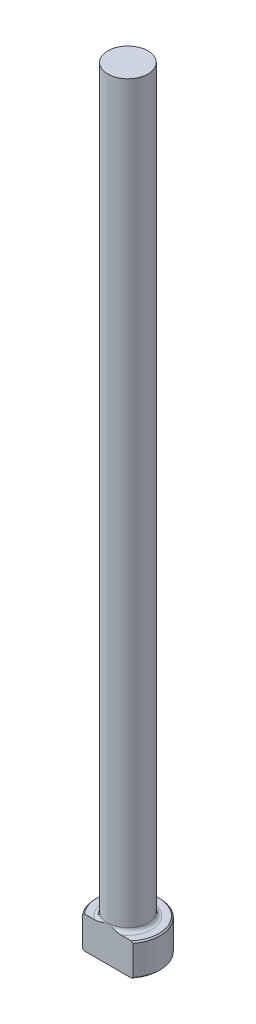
ISO-10303-21;
HEADER;
FILE_DESCRIPTION(('STEP AP214'),'2;1');
FILE_NAME('part.step','',(''),(''),'','','');
FILE_SCHEMA(('AUTOMOTIVE_DESIGN { 1 0 10303 214 1 1 1 1 }'));
ENDSEC;
DATA;
#1=APPLICATION_CONTEXT('core data for automotive mechanical design processes');
#2=APPLICATION_PROTOCOL_DEFINITION('international standard','automotive_design',2000,#1);
#3=PRODUCT_CONTEXT('',#1,'mechanical');
#4=PRODUCT('Part','Part','',(#3));
#5=PRODUCT_RELATED_PRODUCT_CATEGORY('part','',(#4));
#6=PRODUCT_DEFINITION_FORMATION('','',#4);
#7=PRODUCT_DEFINITION_CONTEXT('part definition',#1,'design');
#8=PRODUCT_DEFINITION('design','',#6,#7);
#9=PRODUCT_DEFINITION_SHAPE('','',#8);
#10=(LENGTH_UNIT() NAMED_UNIT(*) SI_UNIT(.MILLI.,.METRE.));
#11=(NAMED_UNIT(*) PLANE_ANGLE_UNIT() SI_UNIT($,.RADIAN.));
#12=(NAMED_UNIT(*) SI_UNIT($,.STERADIAN.) SOLID_ANGLE_UNIT());
#13=UNCERTAINTY_MEASURE_WITH_UNIT(LENGTH_MEASURE(1.E-05),#10,'distance_accuracy_value','');
#14=(GEOMETRIC_REPRESENTATION_CONTEXT(3) GLOBAL_UNCERTAINTY_ASSIGNED_CONTEXT((#13)) GLOBAL_UNIT_ASSIGNED_CONTEXT((#10,
#11,#12)) REPRESENTATION_CONTEXT('',''));
#15=CARTESIAN_POINT('',(0.,0.,0.));
#16=DIRECTION('',(0.,0.,1.));
#17=DIRECTION('',(1.,0.,0.));
#18=AXIS2_PLACEMENT_3D('',#15,#16,#17);
#19=CARTESIAN_POINT('',(0.,0.,0.));
#20=DIRECTION('',(0.,-1.,0.));
#21=DIRECTION('',(0.,0.,-1.));
#22=AXIS2_PLACEMENT_3D('',#19,#20,#21);
#23=PLANE('',#22);
#24=CARTESIAN_POINT('',(0.,0.,0.));
#25=DIRECTION('',(0.,-1.,0.));
#26=DIRECTION('',(0.,0.,-1.));
#27=AXIS2_PLACEMENT_3D('',#24,#25,#26);
#28=CIRCLE('',#27,6.09599999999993);
#29=CARTESIAN_POINT('',(-4.62711999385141,0.,3.96874999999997));
#30=VERTEX_POINT('',#29);
#31=CARTESIAN_POINT('',(4.62711999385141,0.,3.96874999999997));
#32=VERTEX_POINT('',#31);
#33=EDGE_CURVE('E98',#30,#32,#28,.T.);
#34=ORIENTED_EDGE('',*,*,#33,.T.);
#35=DIRECTION('',(-1.,0.,0.));
#36=VECTOR('',#35,1.);
#37=CARTESIAN_POINT('',(-4.95696716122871,0.,3.96874999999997));
#38=LINE('',#37,#36);
#39=EDGE_CURVE('E83',#32,#30,#38,.T.);
#40=ORIENTED_EDGE('',*,*,#39,.T.);
#41=EDGE_LOOP('',(#34,#40));
#42=FACE_BOUND('',#41,.T.);
#43=ADVANCED_FACE('F32',(#42),#23,.T.);
#44=CARTESIAN_POINT('',(0.,259.958771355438,0.));
#45=DIRECTION('',(0.,1.,0.));
#46=DIRECTION('',(0.,0.,1.));
#47=AXIS2_PLACEMENT_3D('',#44,#45,#46);
#48=CYLINDRICAL_SURFACE('',#47,6.34999999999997);
#49=CARTESIAN_POINT('',(0.,6.09599999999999,0.));
#50=DIRECTION('',(0.,1.,0.));
#51=DIRECTION('',(0.,0.,1.));
#52=AXIS2_PLACEMENT_3D('',#49,#50,#51);
#53=CIRCLE('',#52,6.34999999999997);
#54=CARTESIAN_POINT('',(-4.95696716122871,6.09599999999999,3.96874999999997));
#55=VERTEX_POINT('',#54);
#56=CARTESIAN_POINT('',(4.95696716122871,6.09599999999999,3.96874999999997));
#57=VERTEX_POINT('',#56);
#58=EDGE_CURVE('E104',#55,#57,#53,.F.);
#59=ORIENTED_EDGE('',*,*,#58,.T.);
#60=DIRECTION('',(0.,-1.,0.));
#61=VECTOR('',#60,1.);
#62=CARTESIAN_POINT('',(4.95696716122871,152.4,3.96874999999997));
#63=LINE('',#62,#61);
#64=CARTESIAN_POINT('',(4.95696716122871,0.254000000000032,3.96874999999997));
#65=VERTEX_POINT('',#64);
#66=EDGE_CURVE('E183',#57,#65,#63,.T.);
#67=ORIENTED_EDGE('',*,*,#66,.T.);
#68=CARTESIAN_POINT('',(0.,0.254000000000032,0.));
#69=DIRECTION('',(0.,-1.,0.));
#70=DIRECTION('',(0.,0.,-1.));
#71=AXIS2_PLACEMENT_3D('',#68,#69,#70);
#72=CIRCLE('',#71,6.34999999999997);
#73=CARTESIAN_POINT('',(-4.95696716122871,0.254000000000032,3.96874999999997));
#74=VERTEX_POINT('',#73);
#75=EDGE_CURVE('E100',#65,#74,#72,.F.);
#76=ORIENTED_EDGE('',*,*,#75,.T.);
#77=DIRECTION('',(0.,-1.,0.));
#78=VECTOR('',#77,1.);
#79=CARTESIAN_POINT('',(-4.95696716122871,152.4,3.96874999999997));
#80=LINE('',#79,#78);
#81=EDGE_CURVE('E93',#55,#74,#80,.T.);
#82=ORIENTED_EDGE('',*,*,#81,.F.);
#83=EDGE_LOOP('',(#59,#67,#76,#82));
#84=FACE_BOUND('',#83,.T.);
#85=ADVANCED_FACE('F158',(#84),#48,.T.);
#86=CARTESIAN_POINT('',(-6.34999999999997,6.35,0.));
#87=DIRECTION('',(0.,1.,0.));
#88=DIRECTION('',(0.,0.,1.));
#89=AXIS2_PLACEMENT_3D('',#86,#87,#88);
#90=PLANE('',#89);
#91=CARTESIAN_POINT('',(0.,6.35,0.));
#92=DIRECTION('',(0.,1.,0.));
#93=DIRECTION('',(0.,0.,1.));
#94=AXIS2_PLACEMENT_3D('',#91,#92,#93);
#95=CIRCLE('',#94,6.096);
#96=CARTESIAN_POINT('',(4.62711999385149,6.35,3.96874999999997));
#97=VERTEX_POINT('',#96);
#98=CARTESIAN_POINT('',(-4.62711999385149,6.35,3.96874999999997));
#99=VERTEX_POINT('',#98);
#100=EDGE_CURVE('E178',#97,#99,#95,.T.);
#101=ORIENTED_EDGE('',*,*,#100,.T.);
#102=DIRECTION('',(1.,0.,0.));
#103=VECTOR('',#102,1.);
#104=CARTESIAN_POINT('',(-6.34999999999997,6.35,3.96874999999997));
#105=LINE('',#104,#103);
#106=CARTESIAN_POINT('',(-2.57468813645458,6.35000000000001,3.96874999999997));
#107=VERTEX_POINT('',#106);
#108=EDGE_CURVE('E57',#99,#107,#105,.T.);
#109=ORIENTED_EDGE('',*,*,#108,.T.);
#110=CARTESIAN_POINT('',(0.,6.35,0.));
#111=DIRECTION('',(0.,1.,0.));
#112=DIRECTION('',(0.,0.,1.));
#113=AXIS2_PLACEMENT_3D('',#110,#111,#112);
#114=CIRCLE('',#113,4.73074999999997);
#115=CARTESIAN_POINT('',(2.57468813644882,6.35000000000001,3.96874999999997));
#116=VERTEX_POINT('',#115);
#117=EDGE_CURVE('E107',#107,#116,#114,.F.);
#118=ORIENTED_EDGE('',*,*,#117,.T.);
#119=EDGE_CURVE('E136',#116,#97,#105,.T.);
#120=ORIENTED_EDGE('',*,*,#119,.T.);
#121=EDGE_LOOP('',(#101,#109,#118,#120));
#122=FACE_BOUND('',#121,.T.);
#123=ADVANCED_FACE('F147',(#122),#90,.T.);
#124=CARTESIAN_POINT('',(0.,6.35000000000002,0.));
#125=DIRECTION('',(0.,-1.,0.));
#126=DIRECTION('',(0.,0.,-1.));
#127=AXIS2_PLACEMENT_3D('',#124,#125,#126);
#128=CONICAL_SURFACE('',#127,6.09599999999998,0.78539816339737);
#129=ORIENTED_EDGE('',*,*,#58,.F.);
#130=CARTESIAN_POINT('',(-10.9074797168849,0.838929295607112,3.96874999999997));
#131=CARTESIAN_POINT('',(-10.7362098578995,0.999873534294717,3.96874999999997));
#132=CARTESIAN_POINT('',(-10.5647219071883,1.16058556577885,3.96874999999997));
#133=CARTESIAN_POINT('',(-10.2212389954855,1.48146888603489,3.96874999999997));
#134=CARTESIAN_POINT('',(-10.0492440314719,1.64164017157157,3.96874999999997));
#135=CARTESIAN_POINT('',(-9.5321572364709,2.12144657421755,3.96874999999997));
#136=CARTESIAN_POINT('',(-9.18620012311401,2.44015148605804,3.96874999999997));
#137=CARTESIAN_POINT('',(-8.48250908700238,3.0820994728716,3.96874999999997));
#138=CARTESIAN_POINT('',(-8.12469692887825,3.40525689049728,3.96874999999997));
#139=CARTESIAN_POINT('',(-7.40476794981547,4.04632494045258,3.96874999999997));
#140=CARTESIAN_POINT('',(-7.04265387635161,4.36423864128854,3.96874999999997));
#141=CARTESIAN_POINT('',(-6.49464785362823,4.83529502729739,3.96874999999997));
#142=CARTESIAN_POINT('',(-6.31122194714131,4.99130476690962,3.96874999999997));
#143=CARTESIAN_POINT('',(-5.94233504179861,5.30091560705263,3.96874999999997));
#144=CARTESIAN_POINT('',(-5.75687398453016,5.45451663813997,3.96874999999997));
#145=CARTESIAN_POINT('',(-5.38307682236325,5.7589450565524,3.96874999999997));
#146=CARTESIAN_POINT('',(-5.1947357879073,5.90976640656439,3.96874999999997));
#147=CARTESIAN_POINT('',(-4.81490900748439,6.20737957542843,3.96874999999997));
#148=CARTESIAN_POINT('',(-4.62342351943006,6.35417172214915,3.96874999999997));
#149=CARTESIAN_POINT('',(-4.23840402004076,6.64094245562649,3.96874999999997));
#150=CARTESIAN_POINT('',(-4.04491037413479,6.7809749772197,3.96874999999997));
#151=CARTESIAN_POINT('',(-3.6528243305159,7.05394467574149,3.96874999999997));
#152=CARTESIAN_POINT('',(-3.45422994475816,7.18687902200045,3.96874999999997));
#153=CARTESIAN_POINT('',(-3.05130630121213,7.44227984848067,3.96874999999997));
#154=CARTESIAN_POINT('',(-2.84699866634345,7.56478015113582,3.96874999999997));
#155=CARTESIAN_POINT('',(-2.43048905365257,7.79538986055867,3.96874999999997));
#156=CARTESIAN_POINT('',(-2.21829552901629,7.90351413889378,3.96874999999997));
#157=CARTESIAN_POINT('',(-1.88022874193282,8.05571524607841,3.96874999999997));
#158=CARTESIAN_POINT('',(-1.75760714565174,8.10699294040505,3.96874999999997));
#159=CARTESIAN_POINT('',(-1.50924598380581,8.20152084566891,3.96874999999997));
#160=CARTESIAN_POINT('',(-1.38350591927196,8.24476976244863,3.96874999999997));
#161=CARTESIAN_POINT('',(-1.12977963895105,8.32133629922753,3.96874999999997));
#162=CARTESIAN_POINT('',(-1.00181028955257,8.35470906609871,3.96874999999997));
#163=CARTESIAN_POINT('',(-0.74342759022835,8.41019049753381,3.96874999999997));
#164=CARTESIAN_POINT('',(-0.613014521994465,8.43230045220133,3.96874999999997));
#165=CARTESIAN_POINT('',(-0.348820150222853,8.46413643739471,3.96874999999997));
#166=CARTESIAN_POINT('',(-0.215017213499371,8.47368667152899,3.96874999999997));
#167=CARTESIAN_POINT('',(0.0528592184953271,8.47915710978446,3.96874999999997));
#168=CARTESIAN_POINT('',(0.186932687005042,8.47507860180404,3.96874999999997));
#169=CARTESIAN_POINT('',(0.454438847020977,8.45355129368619,3.96874999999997));
#170=CARTESIAN_POINT('',(0.587867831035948,8.4360572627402,3.96874999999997));
#171=CARTESIAN_POINT('',(0.852531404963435,8.38880841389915,3.96874999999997));
#172=CARTESIAN_POINT('',(0.983765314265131,8.35904986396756,3.96874999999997));
#173=CARTESIAN_POINT('',(1.28880023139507,8.27664707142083,3.96874999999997));
#174=CARTESIAN_POINT('',(1.46141329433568,8.21963783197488,3.96874999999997));
#175=CARTESIAN_POINT('',(1.80090006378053,8.09060275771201,3.96874999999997));
#176=CARTESIAN_POINT('',(1.96777052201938,8.01856858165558,3.96874999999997));
#177=CARTESIAN_POINT('',(2.21492486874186,7.90160331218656,3.96874999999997));
#178=CARTESIAN_POINT('',(2.29724213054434,7.86087235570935,3.96874999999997));
#179=CARTESIAN_POINT('',(2.46058693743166,7.77689381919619,3.96874999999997));
#180=CARTESIAN_POINT('',(2.54161446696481,7.7336462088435,3.96874999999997));
#181=CARTESIAN_POINT('',(2.70243717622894,7.64499560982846,3.96874999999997));
#182=CARTESIAN_POINT('',(2.78223280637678,7.59959343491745,3.96874999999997));
#183=CARTESIAN_POINT('',(2.94071403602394,7.50690571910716,3.96874999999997));
#184=CARTESIAN_POINT('',(3.01939969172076,7.45962027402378,3.96874999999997));
#185=CARTESIAN_POINT('',(3.28991241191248,7.2931914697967,3.96874999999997));
#186=CARTESIAN_POINT('',(3.47920753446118,7.16992469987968,3.96874999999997));
#187=CARTESIAN_POINT('',(3.85299575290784,6.9162846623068,3.96874999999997));
#188=CARTESIAN_POINT('',(4.03748740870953,6.78590929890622,3.96874999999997));
#189=CARTESIAN_POINT('',(4.4028151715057,6.5197792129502,3.96874999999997));
#190=CARTESIAN_POINT('',(4.58364746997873,6.38401928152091,3.96874999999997));
#191=CARTESIAN_POINT('',(4.94222498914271,6.10853910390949,3.96874999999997));
#192=CARTESIAN_POINT('',(5.1199705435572,5.96881929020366,3.96874999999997));
#193=CARTESIAN_POINT('',(5.4737355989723,5.68571433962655,3.96874999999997));
#194=CARTESIAN_POINT('',(5.64974474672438,5.54231629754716,3.96874999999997));
#195=CARTESIAN_POINT('',(5.99974206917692,5.25307243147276,3.96874999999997));
#196=CARTESIAN_POINT('',(6.17373019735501,5.10722655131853,3.96874999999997));
#197=CARTESIAN_POINT('',(6.69302814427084,4.66694445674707,3.96874999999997));
#198=CARTESIAN_POINT('',(7.0358720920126,4.36960132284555,3.96874999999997));
#199=CARTESIAN_POINT('',(7.67698172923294,3.80499574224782,3.96874999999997));
#200=CARTESIAN_POINT('',(7.97575257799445,3.53830334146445,3.96874999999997));
#201=CARTESIAN_POINT('',(8.57066794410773,3.0019136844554,3.96874999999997));
#202=CARTESIAN_POINT('',(8.86681204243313,2.73221596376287,3.96874999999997));
#203=CARTESIAN_POINT('',(9.45462121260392,2.19284079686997,3.96874999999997));
#204=CARTESIAN_POINT('',(9.74630307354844,1.92318161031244,3.96874999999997));
#205=CARTESIAN_POINT('',(10.3280138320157,1.38219972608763,3.96874999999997));
#206=CARTESIAN_POINT('',(10.6180430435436,1.11087736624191,3.96874999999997));
#207=CARTESIAN_POINT('',(10.9074797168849,0.838929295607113,3.96874999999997));
#208=B_SPLINE_CURVE_WITH_KNOTS('',3,(#130,#131,#132,#133,#134,#135,#136,#137,#138,#139,#140,
#141,#142,#143,#144,#145,#146,#147,#148,#149,#150,#151,#152,#153,#154,#155,#156,#157,#158,#159,
#160,#161,#162,#163,#164,#165,#166,#167,#168,#169,#170,#171,#172,#173,#174,#175,#176,#177,#178,
#179,#180,#181,#182,#183,#184,#185,#186,#187,#188,#189,#190,#191,#192,#193,#194,#195,#196,#197,
#198,#199,#200,#201,#202,#203,#204,#205,#206,#207),.UNSPECIFIED.,.F.,.F.,(4,2,2,2,2,2,2,2,2,2,2,
2,2,2,2,2,2,2,2,2,2,2,2,2,2,2,2,2,2,2,2,2,2,2,2,2,2,2,4),(0.,0.705072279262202,1.41014876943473,
2.82127665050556,4.2676729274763,5.7131904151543,6.43557153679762,7.15797344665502,
7.88179359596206,8.60555467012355,9.32198841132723,10.0387057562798,10.7530036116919,
11.4665567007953,11.8650702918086,12.2636480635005,12.6599563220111,13.0562191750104,
13.457971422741,13.8596857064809,14.2627603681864,14.6659577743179,15.2103582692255,
15.7550618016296,16.0305566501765,16.306054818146,16.581449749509,16.8568306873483,
17.5342490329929,18.2118681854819,18.8901596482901,19.5683773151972,20.2494368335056,
20.9305119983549,22.2918881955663,23.4933255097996,24.6949511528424,25.8866442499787,
27.078102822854),.UNSPECIFIED.);
#209=EDGE_CURVE('E135',#55,#99,#208,.T.);
#210=ORIENTED_EDGE('',*,*,#209,.T.);
#211=ORIENTED_EDGE('',*,*,#100,.F.);
#212=EDGE_CURVE('E127',#97,#57,#208,.T.);
#213=ORIENTED_EDGE('',*,*,#212,.T.);
#214=EDGE_LOOP('',(#129,#210,#211,#213));
#215=FACE_BOUND('',#214,.T.);
#216=ADVANCED_FACE('F143',(#215),#128,.T.);
#217=CARTESIAN_POINT('',(0.,0.254000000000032,0.));
#218=DIRECTION('',(0.,1.,0.));
#219=DIRECTION('',(0.,0.,1.));
#220=AXIS2_PLACEMENT_3D('',#217,#218,#219);
#221=CONICAL_SURFACE('',#220,6.34999999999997,0.785398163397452);
#222=ORIENTED_EDGE('',*,*,#75,.F.);
#223=CARTESIAN_POINT('',(10.9074797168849,5.51107070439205,3.96874999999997));
#224=CARTESIAN_POINT('',(10.7362098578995,5.35012646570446,3.96874999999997));
#225=CARTESIAN_POINT('',(10.5647219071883,5.18941443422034,3.96874999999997));
#226=CARTESIAN_POINT('',(10.2212389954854,4.86853111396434,3.96874999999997));
#227=CARTESIAN_POINT('',(10.0492440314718,4.70835982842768,3.96874999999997));
#228=CARTESIAN_POINT('',(9.53215723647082,4.22855342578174,3.96874999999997));
#229=CARTESIAN_POINT('',(9.18620012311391,3.90984851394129,3.96874999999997));
#230=CARTESIAN_POINT('',(8.48250908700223,3.26790052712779,3.96874999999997));
#231=CARTESIAN_POINT('',(8.12469692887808,2.94474310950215,3.96874999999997));
#232=CARTESIAN_POINT('',(7.40476794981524,2.3036750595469,3.96874999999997));
#233=CARTESIAN_POINT('',(7.04265387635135,1.98576135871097,3.96874999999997));
#234=CARTESIAN_POINT('',(6.49464785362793,1.51470497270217,3.96874999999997));
#235=CARTESIAN_POINT('',(6.311221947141,1.35869523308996,3.96874999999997));
#236=CARTESIAN_POINT('',(5.94233504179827,1.04908439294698,3.96874999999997));
#237=CARTESIAN_POINT('',(5.75687398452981,0.895483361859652,3.96874999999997));
#238=CARTESIAN_POINT('',(5.38307682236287,0.591054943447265,3.96874999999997));
#239=CARTESIAN_POINT('',(5.19473578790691,0.440233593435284,3.96874999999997));
#240=CARTESIAN_POINT('',(4.81490900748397,0.142620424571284,3.96874999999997));
#241=CARTESIAN_POINT('',(4.62342351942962,-0.00417172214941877,3.96874999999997));
#242=CARTESIAN_POINT('',(4.23840402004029,-0.290942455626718,3.96874999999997));
#243=CARTESIAN_POINT('',(4.04491037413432,-0.430974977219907,3.96874999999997));
#244=CARTESIAN_POINT('',(3.6528243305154,-0.703944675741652,3.96874999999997));
#245=CARTESIAN_POINT('',(3.45422994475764,-0.836879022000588,3.96874999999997));
#246=CARTESIAN_POINT('',(3.05130630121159,-1.09227984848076,3.96874999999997));
#247=CARTESIAN_POINT('',(2.84699866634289,-1.21478015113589,3.96874999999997));
#248=CARTESIAN_POINT('',(2.43048905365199,-1.44538986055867,3.96874999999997));
#249=CARTESIAN_POINT('',(2.2182955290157,-1.55351413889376,3.96874999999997));
#250=CARTESIAN_POINT('',(1.8802287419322,-1.70571524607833,3.96874999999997));
#251=CARTESIAN_POINT('',(1.75760714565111,-1.75699294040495,3.96874999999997));
#252=CARTESIAN_POINT('',(1.50924598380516,-1.85152084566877,3.96874999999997));
#253=CARTESIAN_POINT('',(1.3835059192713,-1.89476976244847,3.96874999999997));
#254=CARTESIAN_POINT('',(1.12977963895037,-1.97133629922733,3.96874999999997));
#255=CARTESIAN_POINT('',(1.00181028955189,-2.00470906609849,3.96874999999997));
#256=CARTESIAN_POINT('',(0.743427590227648,-2.06019049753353,3.96874999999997));
#257=CARTESIAN_POINT('',(0.613014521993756,-2.08230045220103,3.96874999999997));
#258=CARTESIAN_POINT('',(0.348820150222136,-2.11413643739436,3.96874999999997));
#259=CARTESIAN_POINT('',(0.215017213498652,-2.12368667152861,3.96874999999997));
#260=CARTESIAN_POINT('',(-0.0528592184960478,-2.12915710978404,3.96874999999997));
#261=CARTESIAN_POINT('',(-0.186932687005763,-2.1250786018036,3.96874999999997));
#262=CARTESIAN_POINT('',(-0.454438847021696,-2.1035512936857,3.96874999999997));
#263=CARTESIAN_POINT('',(-0.587867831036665,-2.08605726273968,3.96874999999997));
#264=CARTESIAN_POINT('',(-0.852531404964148,-2.0388084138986,3.96874999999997));
#265=CARTESIAN_POINT('',(-0.983765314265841,-2.00904986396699,3.96874999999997));
#266=CARTESIAN_POINT('',(-1.28880023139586,-1.92664707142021,3.96874999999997));
#267=CARTESIAN_POINT('',(-1.46141329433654,-1.86963783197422,3.96874999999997));
#268=CARTESIAN_POINT('',(-1.80090006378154,-1.74060275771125,3.96874999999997));
#269=CARTESIAN_POINT('',(-1.96777052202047,-1.66856858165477,3.96874999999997));
#270=CARTESIAN_POINT('',(-2.21492486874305,-1.55160331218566,3.96874999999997));
#271=CARTESIAN_POINT('',(-2.29724213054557,-1.51087235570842,3.96874999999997));
#272=CARTESIAN_POINT('',(-2.46058693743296,-1.42689381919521,3.96874999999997));
#273=CARTESIAN_POINT('',(-2.54161446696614,-1.38364620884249,3.96874999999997));
#274=CARTESIAN_POINT('',(-2.70243717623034,-1.2949956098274,3.96874999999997));
#275=CARTESIAN_POINT('',(-2.78223280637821,-1.24959343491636,3.96874999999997));
#276=CARTESIAN_POINT('',(-2.94071403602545,-1.15690571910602,3.96874999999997));
#277=CARTESIAN_POINT('',(-3.0193996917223,-1.1096202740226,3.96874999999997));
#278=CARTESIAN_POINT('',(-3.28991241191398,-0.943191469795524,3.96874999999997));
#279=CARTESIAN_POINT('',(-3.47920753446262,-0.819924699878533,3.96874999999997));
#280=CARTESIAN_POINT('',(-3.85299575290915,-0.566284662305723,3.96874999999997));
#281=CARTESIAN_POINT('',(-4.03748740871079,-0.435909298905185,3.96874999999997));
#282=CARTESIAN_POINT('',(-4.40281517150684,-0.169779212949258,3.96874999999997));
#283=CARTESIAN_POINT('',(-4.58364746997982,-0.0340192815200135,3.96874999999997));
#284=CARTESIAN_POINT('',(-4.9422249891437,0.241460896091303,3.96874999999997));
#285=CARTESIAN_POINT('',(-5.11997054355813,0.38118070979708,3.96874999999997));
#286=CARTESIAN_POINT('',(-5.47373559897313,0.664285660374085,3.96874999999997));
#287=CARTESIAN_POINT('',(-5.64974474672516,0.807683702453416,3.96874999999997));
#288=CARTESIAN_POINT('',(-5.99974206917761,1.0969275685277,3.96874999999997));
#289=CARTESIAN_POINT('',(-6.17373019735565,1.24277344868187,3.96874999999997));
#290=CARTESIAN_POINT('',(-6.69302814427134,1.68305554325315,3.96874999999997));
#291=CARTESIAN_POINT('',(-7.03587209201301,1.98039867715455,3.96874999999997));
#292=CARTESIAN_POINT('',(-7.67698172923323,2.54500425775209,3.96874999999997));
#293=CARTESIAN_POINT('',(-7.97575257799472,2.81169665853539,3.96874999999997));
#294=CARTESIAN_POINT('',(-8.57066794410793,3.3480863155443,3.96874999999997));
#295=CARTESIAN_POINT('',(-8.8668120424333,3.61778403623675,3.96874999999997));
#296=CARTESIAN_POINT('',(-9.45462121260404,4.15715920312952,3.96874999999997));
#297=CARTESIAN_POINT('',(-9.74630307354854,4.42681838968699,3.96874999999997));
#298=CARTESIAN_POINT('',(-10.3280138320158,4.96780027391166,3.96874999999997));
#299=CARTESIAN_POINT('',(-10.6180430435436,5.23912263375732,3.96874999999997));
#300=CARTESIAN_POINT('',(-10.9074797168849,5.51107070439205,3.96874999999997));
#301=B_SPLINE_CURVE_WITH_KNOTS('',3,(#223,#224,#225,#226,#227,#228,#229,#230,#231,#232,#233,
#234,#235,#236,#237,#238,#239,#240,#241,#242,#243,#244,#245,#246,#247,#248,#249,#250,#251,#252,
#253,#254,#255,#256,#257,#258,#259,#260,#261,#262,#263,#264,#265,#266,#267,#268,#269,#270,#271,
#272,#273,#274,#275,#276,#277,#278,#279,#280,#281,#282,#283,#284,#285,#286,#287,#288,#289,#290,
#291,#292,#293,#294,#295,#296,#297,#298,#299,#300),.UNSPECIFIED.,.F.,.F.,(4,2,2,2,2,2,2,2,2,2,2,
2,2,2,2,2,2,2,2,2,2,2,2,2,2,2,2,2,2,2,2,2,2,2,2,2,2,2,4),(0.,0.705072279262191,1.4101487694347,
2.82127665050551,4.26767292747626,5.71319041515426,6.43557153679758,7.15797344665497,
7.88179359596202,8.6055546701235,9.32198841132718,10.0387057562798,10.7530036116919,
11.4665567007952,11.8650702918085,12.2636480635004,12.659956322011,13.0562191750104,
13.4579714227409,13.8596857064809,14.2627603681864,14.6659577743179,15.2103582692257,
15.7550618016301,16.0305566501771,16.3060548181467,16.5814497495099,16.8568306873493,
17.5342490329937,18.2118681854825,18.8901596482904,19.5683773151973,20.2494368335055,
20.9305119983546,22.2918881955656,23.4933255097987,24.6949511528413,25.8866442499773,
27.0781028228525),.UNSPECIFIED.);
#302=EDGE_CURVE('E86',#65,#32,#301,.T.);
#303=ORIENTED_EDGE('',*,*,#302,.T.);
#304=ORIENTED_EDGE('',*,*,#33,.F.);
#305=EDGE_CURVE('E89',#30,#74,#301,.T.);
#306=ORIENTED_EDGE('',*,*,#305,.T.);
#307=EDGE_LOOP('',(#222,#303,#304,#306));
#308=FACE_BOUND('',#307,.T.);
#309=ADVANCED_FACE('F97',(#308),#221,.T.);
#310=CARTESIAN_POINT('',(0.,7.11200000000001,0.));
#311=DIRECTION('',(0.,1.,0.));
#312=DIRECTION('',(0.,0.,1.));
#313=AXIS2_PLACEMENT_3D('',#310,#311,#312);
#314=TOROIDAL_SURFACE('',#313,4.73074999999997,0.762);
#315=CARTESIAN_POINT('',(0.,7.11200000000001,3.96874999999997));
#316=CARTESIAN_POINT('',(2.72452919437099E-10,7.11200100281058,3.96874999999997));
#317=CARTESIAN_POINT('',(1.8909757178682E-07,7.11200200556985,3.96874999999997));
#318=CARTESIAN_POINT('',(7.99901126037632E-07,7.11200394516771,3.96874999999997));
#319=CARTESIAN_POINT('',(1.22666624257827E-06,7.11200488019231,3.96874999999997));
#320=CARTESIAN_POINT('',(2.25601477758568E-06,7.11200673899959,3.96874999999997));
#321=CARTESIAN_POINT('',(2.86938872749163E-06,7.11200765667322,3.96874999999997));
#322=CARTESIAN_POINT('',(4.20094100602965E-06,7.11200939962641,3.96874999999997));
#323=CARTESIAN_POINT('',(4.91843246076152E-06,7.11201022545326,3.96874999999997));
#324=CARTESIAN_POINT('',(7.46258045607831E-06,7.11201295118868,3.96874999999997));
#325=CARTESIAN_POINT('',(9.42693843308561E-06,7.1120147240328,3.96874999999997));
#326=CARTESIAN_POINT('',(1.35156238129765E-05,7.11201792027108,3.96874999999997));
#327=CARTESIAN_POINT('',(1.56334419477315E-05,7.11201935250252,3.96874999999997));
#328=CARTESIAN_POINT('',(2.3779436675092E-05,7.11202462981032,3.96874999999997));
#329=CARTESIAN_POINT('',(3.00000425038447E-05,7.11202818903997,3.96874999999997));
#330=CARTESIAN_POINT('',(4.23604378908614E-05,7.11203410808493,3.96874999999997));
#331=CARTESIAN_POINT('',(4.84662900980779E-05,7.11203654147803,3.96874999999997));
#332=CARTESIAN_POINT('',(7.41361994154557E-05,7.11204669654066,3.96874999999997));
#333=CARTESIAN_POINT('',(9.37464431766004E-05,7.11205427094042,3.96874999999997));
#334=CARTESIAN_POINT('',(0.000130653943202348,7.1120666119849,3.96874999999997));
#335=CARTESIAN_POINT('',(0.000147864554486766,7.11207162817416,3.96874999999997));
#336=CARTESIAN_POINT('',(0.000271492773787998,7.11211085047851,3.96874999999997));
#337=CARTESIAN_POINT('',(0.000372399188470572,7.11216017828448,3.96874999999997));
#338=CARTESIAN_POINT('',(0.000762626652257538,7.11234384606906,3.96874999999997));
#339=CARTESIAN_POINT('',(0.00105578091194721,7.11246696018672,3.96874999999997));
#340=CARTESIAN_POINT('',(0.00218658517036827,7.11294905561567,3.96874999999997));
#341=CARTESIAN_POINT('',(0.00302029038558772,7.11331980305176,3.96874999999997));
#342=CARTESIAN_POINT('',(0.00641326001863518,7.1148212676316,3.96874999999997));
#343=CARTESIAN_POINT('',(0.00897690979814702,7.1159386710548,3.96874999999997));
#344=CARTESIAN_POINT('',(0.0431521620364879,7.13084393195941,3.96874999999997));
#345=CARTESIAN_POINT('',(0.0747329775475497,7.14472589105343,3.96874999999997));
#346=CARTESIAN_POINT('',(0.138371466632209,7.17259981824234,3.96874999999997));
#347=CARTESIAN_POINT('',(0.170429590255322,7.18659058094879,3.96874999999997));
#348=CARTESIAN_POINT('',(0.263897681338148,7.22728018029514,3.96874999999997));
#349=CARTESIAN_POINT('',(0.325342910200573,7.25390148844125,3.96874999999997));
#350=CARTESIAN_POINT('',(0.455451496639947,7.30966012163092,3.96874999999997));
#351=CARTESIAN_POINT('',(0.524140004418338,7.33873873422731,3.96874999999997));
#352=CARTESIAN_POINT('',(0.662588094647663,7.39626071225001,3.96874999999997));
#353=CARTESIAN_POINT('',(0.732351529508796,7.42469485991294,3.96874999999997));
#354=CARTESIAN_POINT('',(0.854677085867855,7.47322946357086,3.96874999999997));
#355=CARTESIAN_POINT('',(0.90712454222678,7.49361793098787,3.96874999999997));
#356=CARTESIAN_POINT('',(1.01222990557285,7.5334595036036,3.96874999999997));
#357=CARTESIAN_POINT('',(1.06488701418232,7.55291472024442,3.96874999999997));
#358=CARTESIAN_POINT('',(1.22118224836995,7.60890100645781,3.96874999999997));
#359=CARTESIAN_POINT('',(1.32536392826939,7.64394780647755,3.96874999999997));
#360=CARTESIAN_POINT('',(1.51475689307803,7.70222633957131,3.96874999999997));
#361=CARTESIAN_POINT('',(1.59966831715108,7.72642606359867,3.96874999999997));
#362=CARTESIAN_POINT('',(1.77115576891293,7.77055798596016,3.96874999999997));
#363=CARTESIAN_POINT('',(1.85773874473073,7.79046358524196,3.96874999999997));
#364=CARTESIAN_POINT('',(2.03663433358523,7.8256694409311,3.96874999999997));
#365=CARTESIAN_POINT('',(2.12900742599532,7.84066973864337,3.96874999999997));
#366=CARTESIAN_POINT('',(2.31450882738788,7.86300878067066,3.96874999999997));
#367=CARTESIAN_POINT('',(2.40763490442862,7.87036510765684,3.96874999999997));
#368=CARTESIAN_POINT('',(2.58622461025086,7.87533872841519,3.96874999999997));
#369=CARTESIAN_POINT('',(2.67166229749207,7.87373524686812,3.96874999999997));
#370=CARTESIAN_POINT('',(2.84116133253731,7.86073590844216,3.96874999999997));
#371=CARTESIAN_POINT('',(2.92522821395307,7.84942227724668,3.96874999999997));
#372=CARTESIAN_POINT('',(3.09260159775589,7.81445437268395,3.96874999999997));
#373=CARTESIAN_POINT('',(3.17586039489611,7.79056108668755,3.96874999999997));
#374=CARTESIAN_POINT('',(3.33637449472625,7.72711703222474,3.96874999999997));
#375=CARTESIAN_POINT('',(3.41365062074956,7.6876237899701,3.96874999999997));
#376=CARTESIAN_POINT('',(3.51798857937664,7.61566535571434,3.96874999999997));
#377=CARTESIAN_POINT('',(3.55006318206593,7.59045187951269,3.96874999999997));
#378=CARTESIAN_POINT('',(3.6102188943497,7.53557765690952,3.96874999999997));
#379=CARTESIAN_POINT('',(3.63830099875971,7.50591802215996,3.96874999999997));
#380=CARTESIAN_POINT('',(3.68933162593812,7.44181271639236,3.96874999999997));
#381=CARTESIAN_POINT('',(3.7122145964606,7.40731395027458,3.96874999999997));
#382=CARTESIAN_POINT('',(3.75063172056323,7.3344255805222,3.96874999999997));
#383=CARTESIAN_POINT('',(3.76617854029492,7.29604282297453,3.96874999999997));
#384=CARTESIAN_POINT('',(3.7867432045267,7.22260269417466,3.96874999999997));
#385=CARTESIAN_POINT('',(3.79297266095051,7.18788564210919,3.96874999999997));
#386=CARTESIAN_POINT('',(3.79840708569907,7.11791009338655,3.96874999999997));
#387=CARTESIAN_POINT('',(3.79761729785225,7.08265202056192,3.96874999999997));
#388=CARTESIAN_POINT('',(3.7897274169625,7.01808169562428,3.96874999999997));
#389=CARTESIAN_POINT('',(3.78356056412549,6.98864967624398,3.96874999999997));
#390=CARTESIAN_POINT('',(3.76657344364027,6.93117296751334,3.96874999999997));
#391=CARTESIAN_POINT('',(3.75575305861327,6.90312831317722,3.96874999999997));
#392=CARTESIAN_POINT('',(3.72949416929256,6.84779976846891,3.96874999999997));
#393=CARTESIAN_POINT('',(3.713874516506,6.82060268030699,3.96874999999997));
#394=CARTESIAN_POINT('',(3.67898159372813,6.76868386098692,3.96874999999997));
#395=CARTESIAN_POINT('',(3.6597066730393,6.74396325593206,3.96874999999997));
#396=CARTESIAN_POINT('',(3.60698815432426,6.68446341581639,3.96874999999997));
#397=CARTESIAN_POINT('',(3.57151931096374,6.65147423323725,3.96874999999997));
#398=CARTESIAN_POINT('',(3.49575447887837,6.59155388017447,3.96874999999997));
#399=CARTESIAN_POINT('',(3.45544429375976,6.56464122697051,3.96874999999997));
#400=CARTESIAN_POINT('',(3.35110964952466,6.50463027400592,3.96874999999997));
#401=CARTESIAN_POINT('',(3.2851315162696,6.47494717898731,3.96874999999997));
#402=CARTESIAN_POINT('',(3.1496628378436,6.42615277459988,3.96874999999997));
#403=CARTESIAN_POINT('',(3.08017671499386,6.40702850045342,3.96874999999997));
#404=CARTESIAN_POINT('',(2.95179922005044,6.38006601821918,3.96874999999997));
#405=CARTESIAN_POINT('',(2.89318763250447,6.37083647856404,3.96874999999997));
#406=CARTESIAN_POINT('',(2.77536712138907,6.35745547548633,3.96874999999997));
#407=CARTESIAN_POINT('',(2.71615776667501,6.35330798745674,3.96874999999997));
#408=CARTESIAN_POINT('',(2.53632384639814,6.34734840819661,3.96874999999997));
#409=CARTESIAN_POINT('',(2.41545754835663,6.35237783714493,3.96874999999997));
#410=CARTESIAN_POINT('',(2.21811250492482,6.3716785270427,3.96874999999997));
#411=CARTESIAN_POINT('',(2.14116511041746,6.38201761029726,3.96874999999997));
#412=CARTESIAN_POINT('',(1.98802972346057,6.40734893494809,3.96874999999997));
#413=CARTESIAN_POINT('',(1.91184177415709,6.42234143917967,3.96874999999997));
#414=CARTESIAN_POINT('',(1.68397090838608,6.47322550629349,3.96874999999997));
#415=CARTESIAN_POINT('',(1.53360062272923,6.51495000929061,3.96874999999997));
#416=CARTESIAN_POINT('',(1.24863432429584,6.60495823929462,3.96874999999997));
#417=CARTESIAN_POINT('',(1.1137637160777,6.65241192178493,3.96874999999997));
#418=CARTESIAN_POINT('',(0.847576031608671,6.75264930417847,3.96874999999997));
#419=CARTESIAN_POINT('',(0.716236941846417,6.80537521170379,3.96874999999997));
#420=CARTESIAN_POINT('',(0.544659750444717,6.87676192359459,3.96874999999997));
#421=CARTESIAN_POINT('',(0.503794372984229,6.89395286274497,3.96874999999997));
#422=CARTESIAN_POINT('',(0.421123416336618,6.92903262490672,3.96874999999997));
#423=CARTESIAN_POINT('',(0.379320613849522,6.94692803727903,3.96874999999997));
#424=CARTESIAN_POINT('',(0.308934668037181,6.97725002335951,3.96874999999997));
#425=CARTESIAN_POINT('',(0.280329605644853,6.98962609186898,3.96874999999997));
#426=CARTESIAN_POINT('',(0.22342316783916,7.01433013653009,3.96874999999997));
#427=CARTESIAN_POINT('',(0.195121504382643,7.02665744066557,3.96874999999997));
#428=CARTESIAN_POINT('',(0.141398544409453,7.05009288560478,3.96874999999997));
#429=CARTESIAN_POINT('',(0.115975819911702,7.06119805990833,3.96874999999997));
#430=CARTESIAN_POINT('',(0.0642235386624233,7.08387460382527,3.96874999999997));
#431=CARTESIAN_POINT('',(0.0378947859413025,7.09544818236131,3.96874999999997));
#432=CARTESIAN_POINT('',(0.008980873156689,7.10805968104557,3.96874999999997));
#433=CARTESIAN_POINT('',(0.00642114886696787,7.10917532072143,3.96874999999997));
#434=CARTESIAN_POINT('',(0.00302915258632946,7.11067631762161,3.96874999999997));
#435=CARTESIAN_POINT('',(0.00219250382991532,7.11104837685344,3.96874999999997));
#436=CARTESIAN_POINT('',(0.00105793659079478,7.11153207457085,3.96874999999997));
#437=CARTESIAN_POINT('',(0.000763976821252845,7.11165552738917,3.96874999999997));
#438=CARTESIAN_POINT('',(0.000372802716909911,7.11183964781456,3.96874999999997));
#439=CARTESIAN_POINT('',(0.000271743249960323,7.11188905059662,3.96874999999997));
#440=CARTESIAN_POINT('',(0.000147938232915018,7.11192831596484,3.96874999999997));
#441=CARTESIAN_POINT('',(0.000130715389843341,7.11193333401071,3.96874999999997));
#442=CARTESIAN_POINT('',(9.37813349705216E-05,7.11194568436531,3.96874999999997));
#443=CARTESIAN_POINT('',(7.41570976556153E-05,7.11195326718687,3.96874999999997));
#444=CARTESIAN_POINT('',(4.84714568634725E-05,7.11196343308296,3.96874999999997));
#445=CARTESIAN_POINT('',(4.23636190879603E-05,7.1119658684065,3.96874999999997));
#446=CARTESIAN_POINT('',(2.99995408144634E-05,7.11197179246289,3.96874999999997));
#447=CARTESIAN_POINT('',(2.37773032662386E-05,7.11197535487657,3.96874999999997));
#448=CARTESIAN_POINT('',(1.56298045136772E-05,7.1119806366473,3.96874999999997));
#449=CARTESIAN_POINT('',(1.35118280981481E-05,7.1119820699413,3.96874999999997));
#450=CARTESIAN_POINT('',(9.42304070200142E-06,7.11198526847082,3.96874999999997));
#451=CARTESIAN_POINT('',(7.45874782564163E-06,7.11198704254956,3.96874999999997));
#452=CARTESIAN_POINT('',(4.91494694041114E-06,7.11198977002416,3.96874999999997));
#453=CARTESIAN_POINT('',(4.19760642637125E-06,7.11199059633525,3.96874999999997));
#454=CARTESIAN_POINT('',(2.86644231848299E-06,7.11199234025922,3.96874999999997));
#455=CARTESIAN_POINT('',(2.25330634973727E-06,7.11199325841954,3.96874999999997));
#456=CARTESIAN_POINT('',(1.22453499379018E-06,7.11199511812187,3.96874999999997));
#457=CARTESIAN_POINT('',(7.98099010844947E-07,7.11199605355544,3.96874999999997));
#458=CARTESIAN_POINT('',(1.88090825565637E-07,7.11199799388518,3.96874999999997));
#459=CARTESIAN_POINT('',(-2.72513013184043E-10,7.11199899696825,3.96874999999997));
#460=CARTESIAN_POINT('',(0.,7.11200000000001,3.96874999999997));
#461=B_SPLINE_CURVE_WITH_KNOTS('',3,(#315,#316,#317,#318,#319,#320,#321,#322,#323,#324,#325,
#326,#327,#328,#329,#330,#331,#332,#333,#334,#335,#336,#337,#338,#339,#340,#341,#342,#343,#344,
#345,#346,#347,#348,#349,#350,#351,#352,#353,#354,#355,#356,#357,#358,#359,#360,#361,#362,#363,
#364,#365,#366,#367,#368,#369,#370,#371,#372,#373,#374,#375,#376,#377,#378,#379,#380,#381,#382,
#383,#384,#385,#386,#387,#388,#389,#390,#391,#392,#393,#394,#395,#396,#397,#398,#399,#400,#401,
#402,#403,#404,#405,#406,#407,#408,#409,#410,#411,#412,#413,#414,#415,#416,#417,#418,#419,#420,
#421,#422,#423,#424,#425,#426,#427,#428,#429,#430,#431,#432,#433,#434,#435,#436,#437,#438,#439,
#440,#441,#442,#443,#444,#445,#446,#447,#448,#449,#450,#451,#452,#453,#454,#455,#456,#457,#458,
#459,#460),.UNSPECIFIED.,.T.,.F.,(4,2,2,2,2,2,2,2,2,2,2,2,2,2,2,2,2,2,2,2,2,2,2,2,2,2,2,2,2,2,2,
2,2,2,2,2,2,2,2,2,2,2,2,2,2,2,2,2,2,2,2,2,2,2,2,2,2,2,2,2,2,2,2,2,2,2,2,2,2,2,2,2,4),(0.,
3.00577803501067E-06,6.07432689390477E-06,9.37314627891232E-06,1.26511168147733E-05,
2.05502244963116E-05,2.82140029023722E-05,4.96404894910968E-05,6.9339075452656E-05,
0.000132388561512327,0.000186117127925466,0.000521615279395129,0.00147666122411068,
0.00421247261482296,0.0126037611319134,0.116083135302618,0.221020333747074,0.421909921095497,
0.645676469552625,0.871672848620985,1.04047829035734,1.2088818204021,1.53851282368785,
1.80329858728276,2.06968019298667,2.35017846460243,2.63003009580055,2.8859440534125,
3.13971207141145,3.39848556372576,3.65631358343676,3.77836256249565,3.90038107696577,
4.02386182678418,4.14712859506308,4.25227920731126,4.3573512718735,4.44716152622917,
4.5369740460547,4.63071137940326,4.72449114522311,4.86898620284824,5.01391581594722,
5.22974914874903,5.44531687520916,5.62306851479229,5.80095911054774,6.16266479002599,
6.39547137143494,6.62829110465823,7.09579230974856,7.52455372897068,7.94904482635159,
8.08204777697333,8.21846301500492,8.31196587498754,8.40457450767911,8.48780414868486,
8.57407464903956,8.58245304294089,8.58519851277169,8.58615618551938,8.58649219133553,
8.58654595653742,8.58660905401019,8.58662876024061,8.58665019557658,8.58665786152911,
8.5866657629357,8.58666904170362,8.58667234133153,8.58667541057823,8.58667841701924),.UNSPECIFIED.);
#462=CARTESIAN_POINT('',(0.,7.11200000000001,3.96874999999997));
#463=VERTEX_POINT('',#462);
#464=EDGE_CURVE('E11',#116,#463,#461,.T.);
#465=ORIENTED_EDGE('',*,*,#464,.F.);
#466=ORIENTED_EDGE('',*,*,#117,.F.);
#467=CARTESIAN_POINT('',(0.,7.11200000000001,3.96874999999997));
#468=CARTESIAN_POINT('',(-2.72453064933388E-10,7.11199899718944,3.96874999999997));
#469=CARTESIAN_POINT('',(-1.8909757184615E-07,7.11199799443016,3.96874999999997));
#470=CARTESIAN_POINT('',(-7.99901126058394E-07,7.11199605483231,3.96874999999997));
#471=CARTESIAN_POINT('',(-1.22666624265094E-06,7.1119951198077,3.96874999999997));
#472=CARTESIAN_POINT('',(-2.25601477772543E-06,7.11199326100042,3.96874999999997));
#473=CARTESIAN_POINT('',(-2.86938872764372E-06,7.1119923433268,3.96874999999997));
#474=CARTESIAN_POINT('',(-4.2009410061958E-06,7.11199060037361,3.96874999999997));
#475=CARTESIAN_POINT('',(-4.91843246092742E-06,7.11198977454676,3.96874999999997));
#476=CARTESIAN_POINT('',(-7.46258045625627E-06,7.11198704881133,3.96874999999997));
#477=CARTESIAN_POINT('',(-9.42693843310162E-06,7.11198527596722,3.96874999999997));
#478=CARTESIAN_POINT('',(-1.35156238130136E-05,7.11198207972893,3.96874999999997));
#479=CARTESIAN_POINT('',(-1.56334419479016E-05,7.11198064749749,3.96874999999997));
#480=CARTESIAN_POINT('',(-2.37794366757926E-05,7.11197537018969,3.96874999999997));
#481=CARTESIAN_POINT('',(-3.00000425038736E-05,7.11197181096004,3.96874999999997));
#482=CARTESIAN_POINT('',(-4.2360437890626E-05,7.11196589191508,3.96874999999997));
#483=CARTESIAN_POINT('',(-4.84662900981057E-05,7.11196345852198,3.96874999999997));
#484=CARTESIAN_POINT('',(-7.41361994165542E-05,7.11195330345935,3.96874999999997));
#485=CARTESIAN_POINT('',(-9.37464431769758E-05,7.1119457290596,3.96874999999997));
#486=CARTESIAN_POINT('',(-0.000130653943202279,7.11193338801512,3.96874999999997));
#487=CARTESIAN_POINT('',(-0.000147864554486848,7.11192837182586,3.96874999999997));
#488=CARTESIAN_POINT('',(-0.000271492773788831,7.1118891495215,3.96874999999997));
#489=CARTESIAN_POINT('',(-0.000372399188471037,7.11183982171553,3.96874999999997));
#490=CARTESIAN_POINT('',(-0.000762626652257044,7.11165615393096,3.96874999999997));
#491=CARTESIAN_POINT('',(-0.00105578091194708,7.1115330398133,3.96874999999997));
#492=CARTESIAN_POINT('',(-0.00218658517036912,7.11105094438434,3.96874999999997));
#493=CARTESIAN_POINT('',(-0.00302029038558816,7.11068019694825,3.96874999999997));
#494=CARTESIAN_POINT('',(-0.00641326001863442,7.10917873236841,3.96874999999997));
#495=CARTESIAN_POINT('',(-0.00897690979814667,7.10806132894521,3.96874999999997));
#496=CARTESIAN_POINT('',(-0.0431521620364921,7.09315606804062,3.96874999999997));
#497=CARTESIAN_POINT('',(-0.0747329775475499,7.07927410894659,3.96874999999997));
#498=CARTESIAN_POINT('',(-0.138371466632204,7.05140018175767,3.96874999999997));
#499=CARTESIAN_POINT('',(-0.170429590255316,7.03740941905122,3.96874999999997));
#500=CARTESIAN_POINT('',(-0.263897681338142,6.99671981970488,3.96874999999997));
#501=CARTESIAN_POINT('',(-0.325342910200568,6.97009851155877,3.96874999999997));
#502=CARTESIAN_POINT('',(-0.455451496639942,6.9143398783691,3.96874999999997));
#503=CARTESIAN_POINT('',(-0.524140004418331,6.88526126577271,3.96874999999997));
#504=CARTESIAN_POINT('',(-0.662588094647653,6.82773928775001,3.96874999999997));
#505=CARTESIAN_POINT('',(-0.732351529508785,6.79930514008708,3.96874999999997));
#506=CARTESIAN_POINT('',(-0.854677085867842,6.75077053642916,3.96874999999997));
#507=CARTESIAN_POINT('',(-0.907124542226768,6.73038206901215,3.96874999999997));
#508=CARTESIAN_POINT('',(-1.01222990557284,6.69054049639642,3.96874999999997));
#509=CARTESIAN_POINT('',(-1.06488701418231,6.6710852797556,3.96874999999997));
#510=CARTESIAN_POINT('',(-1.22118224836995,6.61509899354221,3.96874999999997));
#511=CARTESIAN_POINT('',(-1.32536392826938,6.58005219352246,3.96874999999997));
#512=CARTESIAN_POINT('',(-1.51475689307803,6.52177366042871,3.96874999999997));
#513=CARTESIAN_POINT('',(-1.59966831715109,6.49757393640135,3.96874999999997));
#514=CARTESIAN_POINT('',(-1.77115576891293,6.45344201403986,3.96874999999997));
#515=CARTESIAN_POINT('',(-1.85773874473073,6.43353641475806,3.96874999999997));
#516=CARTESIAN_POINT('',(-2.03663433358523,6.39833055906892,3.96874999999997));
#517=CARTESIAN_POINT('',(-2.12900742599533,6.38333026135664,3.96874999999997));
#518=CARTESIAN_POINT('',(-2.31450882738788,6.36099121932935,3.96874999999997));
#519=CARTESIAN_POINT('',(-2.40763490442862,6.35363489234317,3.96874999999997));
#520=CARTESIAN_POINT('',(-2.58622461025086,6.34866127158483,3.96874999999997));
#521=CARTESIAN_POINT('',(-2.67166229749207,6.3502647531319,3.96874999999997));
#522=CARTESIAN_POINT('',(-2.84116133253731,6.36326409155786,3.96874999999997));
#523=CARTESIAN_POINT('',(-2.92522821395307,6.37457772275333,3.96874999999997));
#524=CARTESIAN_POINT('',(-3.09260159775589,6.40954562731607,3.96874999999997));
#525=CARTESIAN_POINT('',(-3.17586039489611,6.43343891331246,3.96874999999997));
#526=CARTESIAN_POINT('',(-3.33637449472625,6.49688296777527,3.96874999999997));
#527=CARTESIAN_POINT('',(-3.41365062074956,6.53637621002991,3.96874999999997));
#528=CARTESIAN_POINT('',(-3.51798857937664,6.60833464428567,3.96874999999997));
#529=CARTESIAN_POINT('',(-3.55006318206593,6.63354812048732,3.96874999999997));
#530=CARTESIAN_POINT('',(-3.6102188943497,6.68842234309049,3.96874999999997));
#531=CARTESIAN_POINT('',(-3.63830099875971,6.71808197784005,3.96874999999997));
#532=CARTESIAN_POINT('',(-3.68933162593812,6.78218728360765,3.96874999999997));
#533=CARTESIAN_POINT('',(-3.7122145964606,6.81668604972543,3.96874999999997));
#534=CARTESIAN_POINT('',(-3.75063172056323,6.88957441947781,3.96874999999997));
#535=CARTESIAN_POINT('',(-3.76617854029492,6.92795717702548,3.96874999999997));
#536=CARTESIAN_POINT('',(-3.7867432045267,7.00139730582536,3.96874999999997));
#537=CARTESIAN_POINT('',(-3.79297266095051,7.03611435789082,3.96874999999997));
#538=CARTESIAN_POINT('',(-3.79840708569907,7.10608990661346,3.96874999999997));
#539=CARTESIAN_POINT('',(-3.79761729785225,7.14134797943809,3.96874999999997));
#540=CARTESIAN_POINT('',(-3.7897274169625,7.20591830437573,3.96874999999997));
#541=CARTESIAN_POINT('',(-3.78356056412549,7.23535032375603,3.96874999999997));
#542=CARTESIAN_POINT('',(-3.76657344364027,7.29282703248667,3.96874999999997));
#543=CARTESIAN_POINT('',(-3.75575305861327,7.32087168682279,3.96874999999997));
#544=CARTESIAN_POINT('',(-3.72949416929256,7.37620023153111,3.96874999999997));
#545=CARTESIAN_POINT('',(-3.713874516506,7.40339731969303,3.96874999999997));
#546=CARTESIAN_POINT('',(-3.67898159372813,7.4553161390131,3.96874999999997));
#547=CARTESIAN_POINT('',(-3.6597066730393,7.48003674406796,3.96874999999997));
#548=CARTESIAN_POINT('',(-3.60698815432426,7.53953658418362,3.96874999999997));
#549=CARTESIAN_POINT('',(-3.57151931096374,7.57252576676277,3.96874999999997));
#550=CARTESIAN_POINT('',(-3.49575447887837,7.63244611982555,3.96874999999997));
#551=CARTESIAN_POINT('',(-3.45544429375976,7.65935877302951,3.96874999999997));
#552=CARTESIAN_POINT('',(-3.35110964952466,7.71936972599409,3.96874999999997));
#553=CARTESIAN_POINT('',(-3.2851315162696,7.7490528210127,3.96874999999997));
#554=CARTESIAN_POINT('',(-3.1496628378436,7.79784722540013,3.96874999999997));
#555=CARTESIAN_POINT('',(-3.08017671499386,7.8169714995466,3.96874999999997));
#556=CARTESIAN_POINT('',(-2.95179922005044,7.84393398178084,3.96874999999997));
#557=CARTESIAN_POINT('',(-2.89318763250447,7.85316352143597,3.96874999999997));
#558=CARTESIAN_POINT('',(-2.77536712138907,7.86654452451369,3.96874999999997));
#559=CARTESIAN_POINT('',(-2.71615776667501,7.87069201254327,3.96874999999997));
#560=CARTESIAN_POINT('',(-2.53632384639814,7.87665159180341,3.96874999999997));
#561=CARTESIAN_POINT('',(-2.41545754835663,7.87162216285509,3.96874999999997));
#562=CARTESIAN_POINT('',(-2.21811250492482,7.85232147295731,3.96874999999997));
#563=CARTESIAN_POINT('',(-2.14116511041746,7.84198238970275,3.96874999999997));
#564=CARTESIAN_POINT('',(-1.98802972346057,7.81665106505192,3.96874999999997));
#565=CARTESIAN_POINT('',(-1.9118417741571,7.80165856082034,3.96874999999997));
#566=CARTESIAN_POINT('',(-1.68397090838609,7.75077449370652,3.96874999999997));
#567=CARTESIAN_POINT('',(-1.53360062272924,7.70904999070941,3.96874999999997));
#568=CARTESIAN_POINT('',(-1.24863432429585,7.61904176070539,3.96874999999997));
#569=CARTESIAN_POINT('',(-1.11376371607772,7.57158807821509,3.96874999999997));
#570=CARTESIAN_POINT('',(-0.847576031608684,7.47135069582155,3.96874999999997));
#571=CARTESIAN_POINT('',(-0.71623694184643,7.41862478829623,3.96874999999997));
#572=CARTESIAN_POINT('',(-0.544659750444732,7.34723807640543,3.96874999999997));
#573=CARTESIAN_POINT('',(-0.503794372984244,7.33004713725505,3.96874999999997));
#574=CARTESIAN_POINT('',(-0.421123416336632,7.2949673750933,3.96874999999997));
#575=CARTESIAN_POINT('',(-0.379320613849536,7.27707196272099,3.96874999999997));
#576=CARTESIAN_POINT('',(-0.308934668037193,7.24674997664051,3.96874999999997));
#577=CARTESIAN_POINT('',(-0.280329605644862,7.23437390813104,3.96874999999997));
#578=CARTESIAN_POINT('',(-0.223423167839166,7.20966986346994,3.96874999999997));
#579=CARTESIAN_POINT('',(-0.195121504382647,7.19734255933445,3.96874999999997));
#580=CARTESIAN_POINT('',(-0.141398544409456,7.17390711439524,3.96874999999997));
#581=CARTESIAN_POINT('',(-0.115975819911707,7.16280194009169,3.96874999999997));
#582=CARTESIAN_POINT('',(-0.0642235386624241,7.14012539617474,3.96874999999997));
#583=CARTESIAN_POINT('',(-0.0378947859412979,7.12855181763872,3.96874999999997));
#584=CARTESIAN_POINT('',(-0.00898087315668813,7.11594031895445,3.96874999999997));
#585=CARTESIAN_POINT('',(-0.00642114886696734,7.11482467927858,3.96874999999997));
#586=CARTESIAN_POINT('',(-0.00302915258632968,7.11332368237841,3.96874999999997));
#587=CARTESIAN_POINT('',(-0.0021925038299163,7.11295162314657,3.96874999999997));
#588=CARTESIAN_POINT('',(-0.00105793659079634,7.11246792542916,3.96874999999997));
#589=CARTESIAN_POINT('',(-0.000763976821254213,7.11234447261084,3.96874999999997));
#590=CARTESIAN_POINT('',(-0.000372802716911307,7.11216035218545,3.96874999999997));
#591=CARTESIAN_POINT('',(-0.000271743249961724,7.1121109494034,3.96874999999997));
#592=CARTESIAN_POINT('',(-0.000147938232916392,7.11207168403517,3.96874999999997));
#593=CARTESIAN_POINT('',(-0.000130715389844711,7.1120666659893,3.96874999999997));
#594=CARTESIAN_POINT('',(-9.37813349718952E-05,7.1120543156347,3.96874999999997));
#595=CARTESIAN_POINT('',(-7.41570976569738E-05,7.11204673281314,3.96874999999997));
#596=CARTESIAN_POINT('',(-4.84714568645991E-05,7.11203656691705,3.96874999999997));
#597=CARTESIAN_POINT('',(-4.2363619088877E-05,7.11203413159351,3.96874999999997));
#598=CARTESIAN_POINT('',(-2.99995408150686E-05,7.11202820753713,3.96874999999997));
#599=CARTESIAN_POINT('',(-2.37773032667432E-05,7.11202464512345,3.96874999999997));
#600=CARTESIAN_POINT('',(-1.56298045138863E-05,7.11201936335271,3.96874999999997));
#601=CARTESIAN_POINT('',(-1.35118280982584E-05,7.11201793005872,3.96874999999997));
#602=CARTESIAN_POINT('',(-9.42304070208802E-06,7.11201473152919,3.96874999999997));
#603=CARTESIAN_POINT('',(-7.4587478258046E-06,7.11201295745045,3.96874999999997));
#604=CARTESIAN_POINT('',(-4.91494694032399E-06,7.11201022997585,3.96874999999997));
#605=CARTESIAN_POINT('',(-4.19760642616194E-06,7.11200940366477,3.96874999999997));
#606=CARTESIAN_POINT('',(-2.86644231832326E-06,7.11200765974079,3.96874999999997));
#607=CARTESIAN_POINT('',(-2.25330634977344E-06,7.11200674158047,3.96874999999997));
#608=CARTESIAN_POINT('',(-1.22453499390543E-06,7.11200488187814,3.96874999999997));
#609=CARTESIAN_POINT('',(-7.98099010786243E-07,7.11200394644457,3.96874999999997));
#610=CARTESIAN_POINT('',(-1.88090825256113E-07,7.11200200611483,3.96874999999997));
#611=CARTESIAN_POINT('',(2.72513158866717E-10,7.11200100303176,3.96874999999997));
#612=CARTESIAN_POINT('',(0.,7.11200000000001,3.96874999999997));
#613=B_SPLINE_CURVE_WITH_KNOTS('',3,(#467,#468,#469,#470,#471,#472,#473,#474,#475,#476,#477,
#478,#479,#480,#481,#482,#483,#484,#485,#486,#487,#488,#489,#490,#491,#492,#493,#494,#495,#496,
#497,#498,#499,#500,#501,#502,#503,#504,#505,#506,#507,#508,#509,#510,#511,#512,#513,#514,#515,
#516,#517,#518,#519,#520,#521,#522,#523,#524,#525,#526,#527,#528,#529,#530,#531,#532,#533,#534,
#535,#536,#537,#538,#539,#540,#541,#542,#543,#544,#545,#546,#547,#548,#549,#550,#551,#552,#553,
#554,#555,#556,#557,#558,#559,#560,#561,#562,#563,#564,#565,#566,#567,#568,#569,#570,#571,#572,
#573,#574,#575,#576,#577,#578,#579,#580,#581,#582,#583,#584,#585,#586,#587,#588,#589,#590,#591,
#592,#593,#594,#595,#596,#597,#598,#599,#600,#601,#602,#603,#604,#605,#606,#607,#608,#609,#610,
#611,#612),.UNSPECIFIED.,.T.,.F.,(4,2,2,2,2,2,2,2,2,2,2,2,2,2,2,2,2,2,2,2,2,2,2,2,2,2,2,2,2,2,2,
2,2,2,2,2,2,2,2,2,2,2,2,2,2,2,2,2,2,2,2,2,2,2,2,2,2,2,2,2,2,2,2,2,2,2,2,2,2,2,2,2,4),(0.,
3.00577803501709E-06,6.07432689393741E-06,9.37314627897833E-06,1.26511168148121E-05,
2.05502244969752E-05,2.82140029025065E-05,4.96404894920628E-05,6.93390754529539E-05,
0.000132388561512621,0.000186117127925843,0.000521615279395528,0.00147666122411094,
0.00421247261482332,0.0126037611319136,0.116083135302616,0.221020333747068,0.421909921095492,
0.645676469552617,0.87167284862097,1.04047829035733,1.20888182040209,1.53851282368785,
1.80329858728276,2.06968019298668,2.35017846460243,2.63003009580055,2.8859440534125,
3.13971207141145,3.39848556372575,3.65631358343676,3.77836256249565,3.90038107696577,
4.02386182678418,4.14712859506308,4.25227920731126,4.3573512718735,4.44716152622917,
4.5369740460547,4.63071137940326,4.7244911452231,4.86898620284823,5.01391581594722,
5.22974914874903,5.44531687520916,5.62306851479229,5.80095911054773,6.16266479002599,
6.39547137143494,6.62829110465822,7.09579230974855,7.52455372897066,7.94904482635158,
8.08204777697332,8.21846301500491,8.31196587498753,8.4045745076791,8.48780414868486,
8.57407464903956,8.58245304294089,8.58519851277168,8.58615618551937,8.58649219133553,
8.58654595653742,8.58660905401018,8.58662876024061,8.58665019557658,8.5866578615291,
8.5866657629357,8.58666904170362,8.58667234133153,8.58667541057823,8.58667841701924),.UNSPECIFIED.);
#614=EDGE_CURVE('E46',#463,#107,#613,.T.);
#615=ORIENTED_EDGE('',*,*,#614,.F.);
#616=CARTESIAN_POINT('',(0.,7.11200000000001,0.));
#617=DIRECTION('',(0.,1.,0.));
#618=DIRECTION('',(0.,0.,1.));
#619=AXIS2_PLACEMENT_3D('',#616,#617,#618);
#620=CIRCLE('',#619,3.96874999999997);
#621=EDGE_CURVE('E103',#463,#463,#620,.T.);
#622=ORIENTED_EDGE('',*,*,#621,.F.);
#623=EDGE_LOOP('',(#465,#466,#615,#622));
#624=FACE_BOUND('',#623,.T.);
#625=ADVANCED_FACE('F34',(#624),#314,.F.);
#626=CARTESIAN_POINT('',(0.,259.958771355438,0.));
#627=DIRECTION('',(0.,1.,0.));
#628=DIRECTION('',(0.,0.,1.));
#629=AXIS2_PLACEMENT_3D('',#626,#627,#628);
#630=CYLINDRICAL_SURFACE('',#629,3.96874999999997);
#631=ORIENTED_EDGE('',*,*,#621,.T.);
#632=EDGE_LOOP('',(#631));
#633=FACE_BOUND('',#632,.T.);
#634=CARTESIAN_POINT('',(0.,152.4,0.));
#635=DIRECTION('',(0.,1.,0.));
#636=DIRECTION('',(0.,0.,1.));
#637=AXIS2_PLACEMENT_3D('',#634,#635,#636);
#638=CIRCLE('',#637,3.96874999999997);
#639=CARTESIAN_POINT('',(0.,152.4,3.96874999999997));
#640=VERTEX_POINT('',#639);
#641=EDGE_CURVE('E101',#640,#640,#638,.T.);
#642=ORIENTED_EDGE('',*,*,#641,.F.);
#643=EDGE_LOOP('',(#642));
#644=FACE_BOUND('',#643,.T.);
#645=ADVANCED_FACE('F155',(#633,#644),#630,.T.);
#646=CARTESIAN_POINT('',(-3.96874999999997,152.4,0.));
#647=DIRECTION('',(0.,1.,0.));
#648=DIRECTION('',(0.,0.,1.));
#649=AXIS2_PLACEMENT_3D('',#646,#647,#648);
#650=PLANE('',#649);
#651=ORIENTED_EDGE('',*,*,#641,.T.);
#652=EDGE_LOOP('',(#651));
#653=FACE_BOUND('',#652,.T.);
#654=ADVANCED_FACE('F121',(#653),#650,.T.);
#655=CARTESIAN_POINT('',(-4.95696716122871,152.4,3.96874999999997));
#656=DIRECTION('',(0.,0.,1.));
#657=DIRECTION('',(1.,0.,0.));
#658=AXIS2_PLACEMENT_3D('',#655,#656,#657);
#659=PLANE('',#658);
#660=ORIENTED_EDGE('',*,*,#66,.F.);
#661=ORIENTED_EDGE('',*,*,#212,.F.);
#662=ORIENTED_EDGE('',*,*,#119,.F.);
#663=ORIENTED_EDGE('',*,*,#464,.T.);
#664=ORIENTED_EDGE('',*,*,#614,.T.);
#665=ORIENTED_EDGE('',*,*,#108,.F.);
#666=ORIENTED_EDGE('',*,*,#209,.F.);
#667=ORIENTED_EDGE('',*,*,#81,.T.);
#668=ORIENTED_EDGE('',*,*,#305,.F.);
#669=ORIENTED_EDGE('',*,*,#39,.F.);
#670=ORIENTED_EDGE('',*,*,#302,.F.);
#671=EDGE_LOOP('',(#660,#661,#662,#663,#664,#665,#666,#667,#668,#669,#670));
#672=FACE_BOUND('',#671,.T.);
#673=ADVANCED_FACE('F85',(#672),#659,.T.);
#674=CLOSED_SHELL('',(#43,#85,#123,#216,#309,#625,#645,#654,#673));
#675=MANIFOLD_SOLID_BREP('B2',#674);
#676=ADVANCED_BREP_SHAPE_REPRESENTATION('',(#18,#675),#14);
#677=SHAPE_DEFINITION_REPRESENTATION(#9,#676);
ENDSEC;
END-ISO-10303-21;
